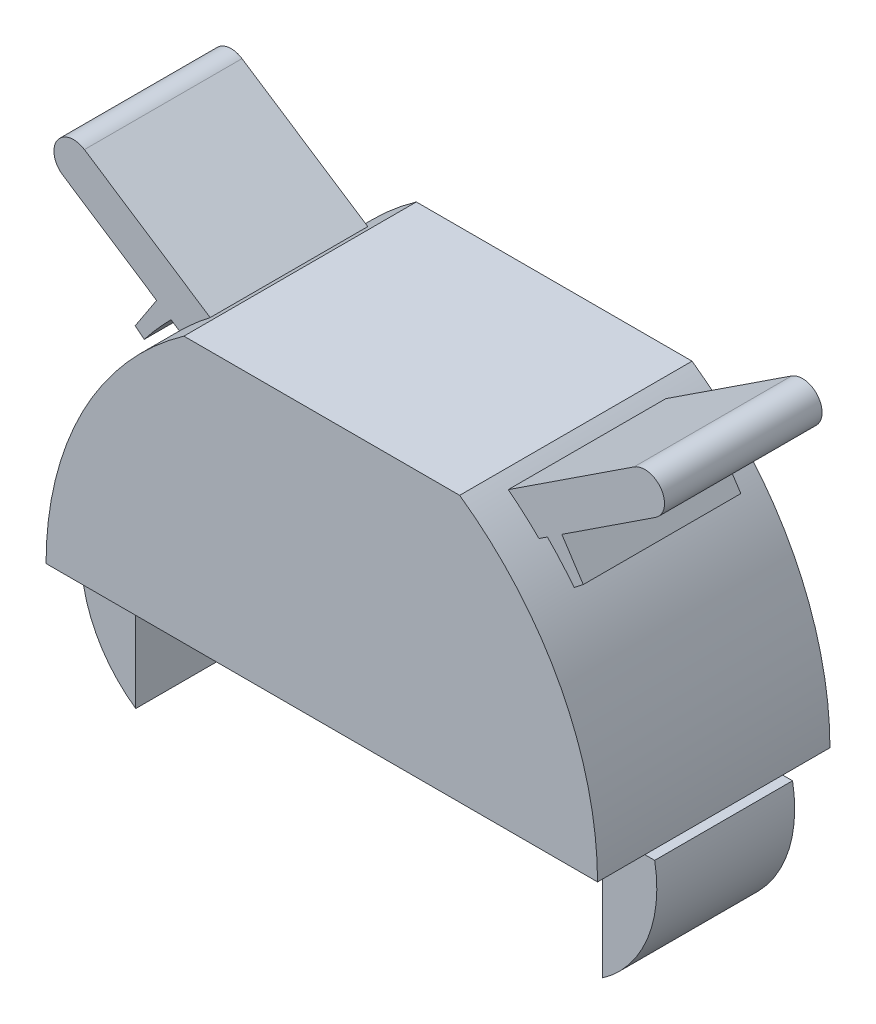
ISO-10303-21;
HEADER;
FILE_DESCRIPTION(('STEP AP214'),'2;1');
FILE_NAME('part.step','',(''),(''),'','','');
FILE_SCHEMA(('AUTOMOTIVE_DESIGN { 1 0 10303 214 1 1 1 1 }'));
ENDSEC;
DATA;
#1=APPLICATION_CONTEXT('core data for automotive mechanical design processes');
#2=APPLICATION_PROTOCOL_DEFINITION('international standard','automotive_design',2000,#1);
#3=PRODUCT_CONTEXT('',#1,'mechanical');
#4=PRODUCT('Part','Part','',(#3));
#5=PRODUCT_RELATED_PRODUCT_CATEGORY('part','',(#4));
#6=PRODUCT_DEFINITION_FORMATION('','',#4);
#7=PRODUCT_DEFINITION_CONTEXT('part definition',#1,'design');
#8=PRODUCT_DEFINITION('design','',#6,#7);
#9=PRODUCT_DEFINITION_SHAPE('','',#8);
#10=(LENGTH_UNIT() NAMED_UNIT(*) SI_UNIT(.MILLI.,.METRE.));
#11=(NAMED_UNIT(*) PLANE_ANGLE_UNIT() SI_UNIT($,.RADIAN.));
#12=(NAMED_UNIT(*) SI_UNIT($,.STERADIAN.) SOLID_ANGLE_UNIT());
#13=UNCERTAINTY_MEASURE_WITH_UNIT(LENGTH_MEASURE(1.E-05),#10,'distance_accuracy_value','');
#14=(GEOMETRIC_REPRESENTATION_CONTEXT(3) GLOBAL_UNCERTAINTY_ASSIGNED_CONTEXT((#13)) GLOBAL_UNIT_ASSIGNED_CONTEXT((#10,
#11,#12)) REPRESENTATION_CONTEXT('',''));
#15=CARTESIAN_POINT('',(0.,0.,0.));
#16=DIRECTION('',(0.,0.,1.));
#17=DIRECTION('',(1.,0.,0.));
#18=AXIS2_PLACEMENT_3D('',#15,#16,#17);
#19=CARTESIAN_POINT('',(2.51785714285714,0.,-5.9));
#20=DIRECTION('',(0.,0.,1.));
#21=DIRECTION('',(1.,0.,0.));
#22=AXIS2_PLACEMENT_3D('',#19,#20,#21);
#23=CYLINDRICAL_SURFACE('',#22,16.5178571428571);
#24=DIRECTION('',(0.,0.,1.));
#25=VECTOR('',#24,1.);
#26=CARTESIAN_POINT('',(-14.,0.,-5.9));
#27=LINE('',#26,#25);
#28=CARTESIAN_POINT('',(-14.,0.,-5.9));
#29=VERTEX_POINT('',#28);
#30=CARTESIAN_POINT('',(-14.,0.,-3.5));
#31=VERTEX_POINT('',#30);
#32=EDGE_CURVE('E483',#29,#31,#27,.T.);
#33=ORIENTED_EDGE('',*,*,#32,.T.);
#34=CARTESIAN_POINT('',(-14.,0.,3.5));
#35=VERTEX_POINT('',#34);
#36=EDGE_CURVE('E485',#31,#35,#27,.T.);
#37=ORIENTED_EDGE('',*,*,#36,.T.);
#38=CARTESIAN_POINT('',(-14.,0.,5.9));
#39=VERTEX_POINT('',#38);
#40=EDGE_CURVE('E486',#35,#39,#27,.T.);
#41=ORIENTED_EDGE('',*,*,#40,.T.);
#42=CARTESIAN_POINT('',(2.51785714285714,0.,5.9));
#43=DIRECTION('',(0.,0.,1.));
#44=DIRECTION('',(-1.,0.,0.));
#45=AXIS2_PLACEMENT_3D('',#42,#43,#44);
#46=CIRCLE('',#45,16.5178571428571);
#47=CARTESIAN_POINT('',(-7.,13.5,5.9));
#48=VERTEX_POINT('',#47);
#49=EDGE_CURVE('E460',#48,#39,#46,.T.);
#50=ORIENTED_EDGE('',*,*,#49,.F.);
#51=DIRECTION('',(0.,0.,1.));
#52=VECTOR('',#51,1.);
#53=CARTESIAN_POINT('',(-7.,13.5,-5.9));
#54=LINE('',#53,#52);
#55=CARTESIAN_POINT('',(-7.,13.5,-5.9));
#56=VERTEX_POINT('',#55);
#57=EDGE_CURVE('E487',#56,#48,#54,.T.);
#58=ORIENTED_EDGE('',*,*,#57,.F.);
#59=CARTESIAN_POINT('',(2.51785714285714,0.,-5.9));
#60=DIRECTION('',(0.,0.,1.));
#61=DIRECTION('',(-1.,0.,0.));
#62=AXIS2_PLACEMENT_3D('',#59,#60,#61);
#63=CIRCLE('',#62,16.5178571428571);
#64=EDGE_CURVE('E472',#56,#29,#63,.T.);
#65=ORIENTED_EDGE('',*,*,#64,.T.);
#66=EDGE_LOOP('',(#33,#37,#41,#50,#58,#65));
#67=FACE_BOUND('',#66,.T.);
#68=DIRECTION('',(0.,0.,1.));
#69=VECTOR('',#68,1.);
#70=CARTESIAN_POINT('',(-9.12659684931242,11.7152164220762,-4.));
#71=LINE('',#70,#69);
#72=CARTESIAN_POINT('',(-9.12659684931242,11.7152164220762,-4.));
#73=VERTEX_POINT('',#72);
#74=CARTESIAN_POINT('',(-9.12659684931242,11.7152164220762,4.));
#75=VERTEX_POINT('',#74);
#76=EDGE_CURVE('E56',#73,#75,#71,.T.);
#77=ORIENTED_EDGE('',*,*,#76,.F.);
#78=CARTESIAN_POINT('',(2.51785714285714,0.,-4.));
#79=DIRECTION('',(0.,0.,1.));
#80=DIRECTION('',(-1.,0.,0.));
#81=AXIS2_PLACEMENT_3D('',#78,#79,#80);
#82=CIRCLE('',#81,16.5178571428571);
#83=CARTESIAN_POINT('',(-7.56564026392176,13.0829157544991,-4.));
#84=VERTEX_POINT('',#83);
#85=EDGE_CURVE('E51',#84,#73,#82,.T.);
#86=ORIENTED_EDGE('',*,*,#85,.F.);
#87=DIRECTION('',(0.,0.,1.));
#88=VECTOR('',#87,1.);
#89=CARTESIAN_POINT('',(-7.56564026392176,13.0829157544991,-4.));
#90=LINE('',#89,#88);
#91=CARTESIAN_POINT('',(-7.56564026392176,13.0829157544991,4.));
#92=VERTEX_POINT('',#91);
#93=EDGE_CURVE('E307',#84,#92,#90,.T.);
#94=ORIENTED_EDGE('',*,*,#93,.T.);
#95=CARTESIAN_POINT('',(2.51785714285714,0.,4.));
#96=DIRECTION('',(0.,0.,1.));
#97=DIRECTION('',(-1.,0.,0.));
#98=AXIS2_PLACEMENT_3D('',#95,#96,#97);
#99=CIRCLE('',#98,16.5178571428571);
#100=EDGE_CURVE('E266',#92,#75,#99,.T.);
#101=ORIENTED_EDGE('',*,*,#100,.T.);
#102=EDGE_LOOP('',(#77,#86,#94,#101));
#103=FACE_BOUND('',#102,.T.);
#104=ADVANCED_FACE('F33',(#67,#103),#23,.T.);
#105=CARTESIAN_POINT('',(-2.51785714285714,0.,-5.9));
#106=DIRECTION('',(0.,0.,1.));
#107=DIRECTION('',(1.,0.,0.));
#108=AXIS2_PLACEMENT_3D('',#105,#106,#107);
#109=CYLINDRICAL_SURFACE('',#108,16.5178571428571);
#110=DIRECTION('',(0.,0.,1.));
#111=VECTOR('',#110,1.);
#112=CARTESIAN_POINT('',(7.,13.5,-5.9));
#113=LINE('',#112,#111);
#114=CARTESIAN_POINT('',(7.,13.5,-5.9));
#115=VERTEX_POINT('',#114);
#116=CARTESIAN_POINT('',(7.,13.5,5.9));
#117=VERTEX_POINT('',#116);
#118=EDGE_CURVE('E37',#115,#117,#113,.T.);
#119=ORIENTED_EDGE('',*,*,#118,.T.);
#120=CARTESIAN_POINT('',(-2.51785714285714,0.,5.9));
#121=DIRECTION('',(0.,0.,1.));
#122=DIRECTION('',(1.,0.,0.));
#123=AXIS2_PLACEMENT_3D('',#120,#121,#122);
#124=CIRCLE('',#123,16.5178571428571);
#125=CARTESIAN_POINT('',(14.,0.,5.9));
#126=VERTEX_POINT('',#125);
#127=EDGE_CURVE('E446',#126,#117,#124,.T.);
#128=ORIENTED_EDGE('',*,*,#127,.F.);
#129=DIRECTION('',(0.,0.,1.));
#130=VECTOR('',#129,1.);
#131=CARTESIAN_POINT('',(14.,0.,-5.9));
#132=LINE('',#131,#130);
#133=CARTESIAN_POINT('',(14.,0.,3.5));
#134=VERTEX_POINT('',#133);
#135=EDGE_CURVE('E482',#134,#126,#132,.T.);
#136=ORIENTED_EDGE('',*,*,#135,.F.);
#137=CARTESIAN_POINT('',(14.,0.,-3.5));
#138=VERTEX_POINT('',#137);
#139=EDGE_CURVE('E481',#138,#134,#132,.T.);
#140=ORIENTED_EDGE('',*,*,#139,.F.);
#141=CARTESIAN_POINT('',(14.,0.,-5.9));
#142=VERTEX_POINT('',#141);
#143=EDGE_CURVE('E478',#142,#138,#132,.T.);
#144=ORIENTED_EDGE('',*,*,#143,.F.);
#145=CARTESIAN_POINT('',(-2.51785714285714,0.,-5.9));
#146=DIRECTION('',(0.,0.,1.));
#147=DIRECTION('',(1.,0.,0.));
#148=AXIS2_PLACEMENT_3D('',#145,#146,#147);
#149=CIRCLE('',#148,16.5178571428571);
#150=EDGE_CURVE('E466',#142,#115,#149,.T.);
#151=ORIENTED_EDGE('',*,*,#150,.T.);
#152=EDGE_LOOP('',(#119,#128,#136,#140,#144,#151));
#153=FACE_BOUND('',#152,.T.);
#154=DIRECTION('',(0.,0.,1.));
#155=VECTOR('',#154,1.);
#156=CARTESIAN_POINT('',(7.56564026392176,13.0829157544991,-4.));
#157=LINE('',#156,#155);
#158=CARTESIAN_POINT('',(7.56564026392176,13.0829157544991,-4.));
#159=VERTEX_POINT('',#158);
#160=CARTESIAN_POINT('',(7.56564026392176,13.0829157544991,4.));
#161=VERTEX_POINT('',#160);
#162=EDGE_CURVE('E362',#159,#161,#157,.T.);
#163=ORIENTED_EDGE('',*,*,#162,.F.);
#164=CARTESIAN_POINT('',(-2.51785714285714,0.,-4.));
#165=DIRECTION('',(0.,0.,-1.));
#166=DIRECTION('',(1.,0.,0.));
#167=AXIS2_PLACEMENT_3D('',#164,#165,#166);
#168=CIRCLE('',#167,16.5178571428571);
#169=CARTESIAN_POINT('',(9.12659684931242,11.7152164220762,-4.));
#170=VERTEX_POINT('',#169);
#171=EDGE_CURVE('E351',#159,#170,#168,.T.);
#172=ORIENTED_EDGE('',*,*,#171,.T.);
#173=DIRECTION('',(0.,0.,1.));
#174=VECTOR('',#173,1.);
#175=CARTESIAN_POINT('',(9.12659684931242,11.7152164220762,-4.));
#176=LINE('',#175,#174);
#177=CARTESIAN_POINT('',(9.12659684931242,11.7152164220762,4.));
#178=VERTEX_POINT('',#177);
#179=EDGE_CURVE('E360',#170,#178,#176,.T.);
#180=ORIENTED_EDGE('',*,*,#179,.T.);
#181=CARTESIAN_POINT('',(-2.51785714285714,0.,4.));
#182=DIRECTION('',(0.,0.,-1.));
#183=DIRECTION('',(1.,0.,0.));
#184=AXIS2_PLACEMENT_3D('',#181,#182,#183);
#185=CIRCLE('',#184,16.5178571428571);
#186=EDGE_CURVE('E327',#161,#178,#185,.T.);
#187=ORIENTED_EDGE('',*,*,#186,.F.);
#188=EDGE_LOOP('',(#163,#172,#180,#187));
#189=FACE_BOUND('',#188,.T.);
#190=ADVANCED_FACE('F35',(#153,#189),#109,.T.);
#191=CARTESIAN_POINT('',(-14.,0.,-5.9));
#192=DIRECTION('',(0.,-1.,0.));
#193=DIRECTION('',(0.,0.,-1.));
#194=AXIS2_PLACEMENT_3D('',#191,#192,#193);
#195=PLANE('',#194);
#196=DIRECTION('',(-1.,0.,0.));
#197=VECTOR('',#196,1.);
#198=CARTESIAN_POINT('',(-14.,0.,-3.5));
#199=LINE('',#198,#197);
#200=CARTESIAN_POINT('',(-12.,0.,-3.5));
#201=VERTEX_POINT('',#200);
#202=EDGE_CURVE('E401',#201,#31,#199,.T.);
#203=ORIENTED_EDGE('',*,*,#202,.T.);
#204=ORIENTED_EDGE('',*,*,#32,.F.);
#205=DIRECTION('',(1.,0.,0.));
#206=VECTOR('',#205,1.);
#207=CARTESIAN_POINT('',(-14.,0.,-5.9));
#208=LINE('',#207,#206);
#209=EDGE_CURVE('E475',#29,#142,#208,.T.);
#210=ORIENTED_EDGE('',*,*,#209,.T.);
#211=ORIENTED_EDGE('',*,*,#143,.T.);
#212=DIRECTION('',(-1.,0.,0.));
#213=VECTOR('',#212,1.);
#214=CARTESIAN_POINT('',(14.,0.,-3.5));
#215=LINE('',#214,#213);
#216=CARTESIAN_POINT('',(12.,0.,-3.5));
#217=VERTEX_POINT('',#216);
#218=EDGE_CURVE('E42',#138,#217,#215,.T.);
#219=ORIENTED_EDGE('',*,*,#218,.T.);
#220=DIRECTION('',(0.,0.,1.));
#221=VECTOR('',#220,1.);
#222=CARTESIAN_POINT('',(12.,0.,-3.5));
#223=LINE('',#222,#221);
#224=CARTESIAN_POINT('',(12.,0.,3.5));
#225=VERTEX_POINT('',#224);
#226=EDGE_CURVE('E443',#217,#225,#223,.T.);
#227=ORIENTED_EDGE('',*,*,#226,.T.);
#228=DIRECTION('',(-1.,0.,0.));
#229=VECTOR('',#228,1.);
#230=CARTESIAN_POINT('',(14.,0.,3.5));
#231=LINE('',#230,#229);
#232=EDGE_CURVE('E11',#134,#225,#231,.T.);
#233=ORIENTED_EDGE('',*,*,#232,.F.);
#234=ORIENTED_EDGE('',*,*,#135,.T.);
#235=DIRECTION('',(1.,0.,0.));
#236=VECTOR('',#235,1.);
#237=CARTESIAN_POINT('',(-14.,0.,5.9));
#238=LINE('',#237,#236);
#239=EDGE_CURVE('E463',#39,#126,#238,.T.);
#240=ORIENTED_EDGE('',*,*,#239,.F.);
#241=ORIENTED_EDGE('',*,*,#40,.F.);
#242=DIRECTION('',(-1.,0.,0.));
#243=VECTOR('',#242,1.);
#244=CARTESIAN_POINT('',(-14.,0.,3.5));
#245=LINE('',#244,#243);
#246=CARTESIAN_POINT('',(-12.,0.,3.5));
#247=VERTEX_POINT('',#246);
#248=EDGE_CURVE('E386',#247,#35,#245,.T.);
#249=ORIENTED_EDGE('',*,*,#248,.F.);
#250=DIRECTION('',(0.,0.,1.));
#251=VECTOR('',#250,1.);
#252=CARTESIAN_POINT('',(-12.,0.,-3.5));
#253=LINE('',#252,#251);
#254=EDGE_CURVE('E408',#201,#247,#253,.T.);
#255=ORIENTED_EDGE('',*,*,#254,.F.);
#256=EDGE_LOOP('',(#203,#204,#210,#211,#219,#227,#233,#234,#240,#241,#249,#255));
#257=FACE_BOUND('',#256,.T.);
#258=ADVANCED_FACE('F503',(#257),#195,.T.);
#259=CARTESIAN_POINT('',(-7.,13.5,-5.9));
#260=DIRECTION('',(0.,1.,0.));
#261=DIRECTION('',(0.,0.,1.));
#262=AXIS2_PLACEMENT_3D('',#259,#260,#261);
#263=PLANE('',#262);
#264=ORIENTED_EDGE('',*,*,#57,.T.);
#265=DIRECTION('',(-1.,0.,0.));
#266=VECTOR('',#265,1.);
#267=CARTESIAN_POINT('',(-7.,13.5,5.9));
#268=LINE('',#267,#266);
#269=EDGE_CURVE('E457',#117,#48,#268,.T.);
#270=ORIENTED_EDGE('',*,*,#269,.F.);
#271=ORIENTED_EDGE('',*,*,#118,.F.);
#272=DIRECTION('',(-1.,0.,0.));
#273=VECTOR('',#272,1.);
#274=CARTESIAN_POINT('',(-7.,13.5,-5.9));
#275=LINE('',#274,#273);
#276=EDGE_CURVE('E469',#115,#56,#275,.T.);
#277=ORIENTED_EDGE('',*,*,#276,.T.);
#278=EDGE_LOOP('',(#264,#270,#271,#277));
#279=FACE_BOUND('',#278,.T.);
#280=ADVANCED_FACE('F496',(#279),#263,.T.);
#281=CARTESIAN_POINT('',(-2.51785714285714,0.,-5.9));
#282=DIRECTION('',(0.,0.,1.));
#283=DIRECTION('',(1.,0.,0.));
#284=AXIS2_PLACEMENT_3D('',#281,#282,#283);
#285=PLANE('',#284);
#286=ORIENTED_EDGE('',*,*,#150,.F.);
#287=ORIENTED_EDGE('',*,*,#209,.F.);
#288=ORIENTED_EDGE('',*,*,#64,.F.);
#289=ORIENTED_EDGE('',*,*,#276,.F.);
#290=EDGE_LOOP('',(#286,#287,#288,#289));
#291=FACE_BOUND('',#290,.T.);
#292=ADVANCED_FACE('F535',(#291),#285,.F.);
#293=CARTESIAN_POINT('',(-2.51785714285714,0.,5.9));
#294=DIRECTION('',(0.,0.,1.));
#295=DIRECTION('',(1.,0.,0.));
#296=AXIS2_PLACEMENT_3D('',#293,#294,#295);
#297=PLANE('',#296);
#298=ORIENTED_EDGE('',*,*,#127,.T.);
#299=ORIENTED_EDGE('',*,*,#269,.T.);
#300=ORIENTED_EDGE('',*,*,#49,.T.);
#301=ORIENTED_EDGE('',*,*,#239,.T.);
#302=EDGE_LOOP('',(#298,#299,#300,#301));
#303=FACE_BOUND('',#302,.T.);
#304=ADVANCED_FACE('F499',(#303),#297,.T.);
#305=CARTESIAN_POINT('',(14.,0.,-3.5));
#306=DIRECTION('',(0.,1.,0.));
#307=DIRECTION('',(0.,0.,1.));
#308=AXIS2_PLACEMENT_3D('',#305,#306,#307);
#309=PLANE('',#308);
#310=CARTESIAN_POINT('',(14.5,0.,-3.5));
#311=VERTEX_POINT('',#310);
#312=EDGE_CURVE('E428',#311,#138,#215,.T.);
#313=ORIENTED_EDGE('',*,*,#312,.T.);
#314=ORIENTED_EDGE('',*,*,#139,.T.);
#315=CARTESIAN_POINT('',(14.5,0.,3.5));
#316=VERTEX_POINT('',#315);
#317=EDGE_CURVE('E44',#316,#134,#231,.T.);
#318=ORIENTED_EDGE('',*,*,#317,.F.);
#319=DIRECTION('',(0.,0.,1.));
#320=VECTOR('',#319,1.);
#321=CARTESIAN_POINT('',(14.5,0.,-3.5));
#322=LINE('',#321,#320);
#323=EDGE_CURVE('E444',#311,#316,#322,.T.);
#324=ORIENTED_EDGE('',*,*,#323,.F.);
#325=EDGE_LOOP('',(#313,#314,#318,#324));
#326=FACE_BOUND('',#325,.T.);
#327=ADVANCED_FACE('F510',(#326),#309,.T.);
#328=CARTESIAN_POINT('',(8.12101233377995,-1.18724835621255,-3.5));
#329=DIRECTION('',(0.,0.,1.));
#330=DIRECTION('',(1.,0.,0.));
#331=AXIS2_PLACEMENT_3D('',#328,#329,#330);
#332=CYLINDRICAL_SURFACE('',#331,6.48853159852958);
#333=ORIENTED_EDGE('',*,*,#323,.T.);
#334=CARTESIAN_POINT('',(8.12101233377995,-1.18724835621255,3.5));
#335=DIRECTION('',(0.,0.,1.));
#336=DIRECTION('',(1.,0.,0.));
#337=AXIS2_PLACEMENT_3D('',#334,#335,#336);
#338=CIRCLE('',#337,6.48853159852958);
#339=CARTESIAN_POINT('',(11.8460240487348,-6.5,3.5));
#340=VERTEX_POINT('',#339);
#341=EDGE_CURVE('E425',#340,#316,#338,.T.);
#342=ORIENTED_EDGE('',*,*,#341,.F.);
#343=DIRECTION('',(0.,0.,1.));
#344=VECTOR('',#343,1.);
#345=CARTESIAN_POINT('',(11.8460240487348,-6.5,-3.5));
#346=LINE('',#345,#344);
#347=CARTESIAN_POINT('',(11.8460240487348,-6.5,-3.5));
#348=VERTEX_POINT('',#347);
#349=EDGE_CURVE('E447',#348,#340,#346,.T.);
#350=ORIENTED_EDGE('',*,*,#349,.F.);
#351=CARTESIAN_POINT('',(8.12101233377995,-1.18724835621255,-3.5));
#352=DIRECTION('',(0.,0.,1.));
#353=DIRECTION('',(1.,0.,0.));
#354=AXIS2_PLACEMENT_3D('',#351,#352,#353);
#355=CIRCLE('',#354,6.48853159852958);
#356=EDGE_CURVE('E440',#348,#311,#355,.T.);
#357=ORIENTED_EDGE('',*,*,#356,.T.);
#358=EDGE_LOOP('',(#333,#342,#350,#357));
#359=FACE_BOUND('',#358,.T.);
#360=ADVANCED_FACE('F518',(#359),#332,.T.);
#361=CARTESIAN_POINT('',(11.8460240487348,-1.3,-3.5));
#362=DIRECTION('',(-1.,0.,0.));
#363=DIRECTION('',(0.,0.,1.));
#364=AXIS2_PLACEMENT_3D('',#361,#362,#363);
#365=PLANE('',#364);
#366=ORIENTED_EDGE('',*,*,#349,.T.);
#367=DIRECTION('',(0.,-1.,0.));
#368=VECTOR('',#367,1.);
#369=CARTESIAN_POINT('',(11.8460240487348,-1.3,3.5));
#370=LINE('',#369,#368);
#371=CARTESIAN_POINT('',(11.8460240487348,-1.3,3.5));
#372=VERTEX_POINT('',#371);
#373=EDGE_CURVE('E422',#372,#340,#370,.T.);
#374=ORIENTED_EDGE('',*,*,#373,.F.);
#375=DIRECTION('',(0.,0.,1.));
#376=VECTOR('',#375,1.);
#377=CARTESIAN_POINT('',(11.8460240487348,-1.3,-3.5));
#378=LINE('',#377,#376);
#379=CARTESIAN_POINT('',(11.8460240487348,-1.3,-3.5));
#380=VERTEX_POINT('',#379);
#381=EDGE_CURVE('E449',#380,#372,#378,.T.);
#382=ORIENTED_EDGE('',*,*,#381,.F.);
#383=DIRECTION('',(0.,-1.,0.));
#384=VECTOR('',#383,1.);
#385=CARTESIAN_POINT('',(11.8460240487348,-1.3,-3.5));
#386=LINE('',#385,#384);
#387=EDGE_CURVE('E437',#380,#348,#386,.T.);
#388=ORIENTED_EDGE('',*,*,#387,.T.);
#389=EDGE_LOOP('',(#366,#374,#382,#388));
#390=FACE_BOUND('',#389,.T.);
#391=ADVANCED_FACE('F525',(#390),#365,.T.);
#392=CARTESIAN_POINT('',(12.,-1.3,-3.5));
#393=DIRECTION('',(0.,1.,0.));
#394=DIRECTION('',(-1.,0.,0.));
#395=AXIS2_PLACEMENT_3D('',#392,#393,#394);
#396=PLANE('',#395);
#397=ORIENTED_EDGE('',*,*,#381,.T.);
#398=DIRECTION('',(-1.,0.,0.));
#399=VECTOR('',#398,1.);
#400=CARTESIAN_POINT('',(12.,-1.3,3.5));
#401=LINE('',#400,#399);
#402=CARTESIAN_POINT('',(12.,-1.3,3.5));
#403=VERTEX_POINT('',#402);
#404=EDGE_CURVE('E419',#403,#372,#401,.T.);
#405=ORIENTED_EDGE('',*,*,#404,.F.);
#406=DIRECTION('',(0.,0.,1.));
#407=VECTOR('',#406,1.);
#408=CARTESIAN_POINT('',(12.,-1.3,-3.5));
#409=LINE('',#408,#407);
#410=CARTESIAN_POINT('',(12.,-1.3,-3.5));
#411=VERTEX_POINT('',#410);
#412=EDGE_CURVE('E451',#411,#403,#409,.T.);
#413=ORIENTED_EDGE('',*,*,#412,.F.);
#414=DIRECTION('',(-1.,0.,0.));
#415=VECTOR('',#414,1.);
#416=CARTESIAN_POINT('',(12.,-1.3,-3.5));
#417=LINE('',#416,#415);
#418=EDGE_CURVE('E434',#411,#380,#417,.T.);
#419=ORIENTED_EDGE('',*,*,#418,.T.);
#420=EDGE_LOOP('',(#397,#405,#413,#419));
#421=FACE_BOUND('',#420,.T.);
#422=ADVANCED_FACE('F528',(#421),#396,.T.);
#423=CARTESIAN_POINT('',(12.,0.,-3.5));
#424=DIRECTION('',(-1.,0.,0.));
#425=DIRECTION('',(0.,0.,1.));
#426=AXIS2_PLACEMENT_3D('',#423,#424,#425);
#427=PLANE('',#426);
#428=ORIENTED_EDGE('',*,*,#412,.T.);
#429=DIRECTION('',(0.,-1.,0.));
#430=VECTOR('',#429,1.);
#431=CARTESIAN_POINT('',(12.,0.,3.5));
#432=LINE('',#431,#430);
#433=EDGE_CURVE('E416',#225,#403,#432,.T.);
#434=ORIENTED_EDGE('',*,*,#433,.F.);
#435=ORIENTED_EDGE('',*,*,#226,.F.);
#436=DIRECTION('',(0.,-1.,0.));
#437=VECTOR('',#436,1.);
#438=CARTESIAN_POINT('',(12.,0.,-3.5));
#439=LINE('',#438,#437);
#440=EDGE_CURVE('E431',#217,#411,#439,.T.);
#441=ORIENTED_EDGE('',*,*,#440,.T.);
#442=EDGE_LOOP('',(#428,#434,#435,#441));
#443=FACE_BOUND('',#442,.T.);
#444=ADVANCED_FACE('F531',(#443),#427,.T.);
#445=CARTESIAN_POINT('',(8.12101233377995,-1.18724835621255,-3.5));
#446=DIRECTION('',(0.,0.,1.));
#447=DIRECTION('',(1.,0.,0.));
#448=AXIS2_PLACEMENT_3D('',#445,#446,#447);
#449=PLANE('',#448);
#450=ORIENTED_EDGE('',*,*,#312,.F.);
#451=ORIENTED_EDGE('',*,*,#356,.F.);
#452=ORIENTED_EDGE('',*,*,#387,.F.);
#453=ORIENTED_EDGE('',*,*,#418,.F.);
#454=ORIENTED_EDGE('',*,*,#440,.F.);
#455=ORIENTED_EDGE('',*,*,#218,.F.);
#456=EDGE_LOOP('',(#450,#451,#452,#453,#454,#455));
#457=FACE_BOUND('',#456,.T.);
#458=ADVANCED_FACE('F522',(#457),#449,.F.);
#459=CARTESIAN_POINT('',(8.12101233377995,-1.18724835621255,3.5));
#460=DIRECTION('',(0.,0.,1.));
#461=DIRECTION('',(1.,0.,0.));
#462=AXIS2_PLACEMENT_3D('',#459,#460,#461);
#463=PLANE('',#462);
#464=ORIENTED_EDGE('',*,*,#317,.T.);
#465=ORIENTED_EDGE('',*,*,#232,.T.);
#466=ORIENTED_EDGE('',*,*,#433,.T.);
#467=ORIENTED_EDGE('',*,*,#404,.T.);
#468=ORIENTED_EDGE('',*,*,#373,.T.);
#469=ORIENTED_EDGE('',*,*,#341,.T.);
#470=EDGE_LOOP('',(#464,#465,#466,#467,#468,#469));
#471=FACE_BOUND('',#470,.T.);
#472=ADVANCED_FACE('F513',(#471),#463,.T.);
#473=CARTESIAN_POINT('',(-8.12101233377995,-1.18724835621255,-3.5));
#474=DIRECTION('',(0.,0.,1.));
#475=DIRECTION('',(1.,0.,0.));
#476=AXIS2_PLACEMENT_3D('',#473,#474,#475);
#477=CYLINDRICAL_SURFACE('',#476,6.48853159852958);
#478=DIRECTION('',(0.,0.,1.));
#479=VECTOR('',#478,1.);
#480=CARTESIAN_POINT('',(-11.8460240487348,-6.5,-3.5));
#481=LINE('',#480,#479);
#482=CARTESIAN_POINT('',(-11.8460240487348,-6.5,-3.5));
#483=VERTEX_POINT('',#482);
#484=CARTESIAN_POINT('',(-11.8460240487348,-6.5,3.5));
#485=VERTEX_POINT('',#484);
#486=EDGE_CURVE('E404',#483,#485,#481,.T.);
#487=ORIENTED_EDGE('',*,*,#486,.T.);
#488=CARTESIAN_POINT('',(-8.12101233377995,-1.18724835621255,3.5));
#489=DIRECTION('',(0.,0.,1.));
#490=DIRECTION('',(-1.,0.,0.));
#491=AXIS2_PLACEMENT_3D('',#488,#489,#490);
#492=CIRCLE('',#491,6.48853159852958);
#493=CARTESIAN_POINT('',(-14.5,0.,3.5));
#494=VERTEX_POINT('',#493);
#495=EDGE_CURVE('E359',#494,#485,#492,.T.);
#496=ORIENTED_EDGE('',*,*,#495,.F.);
#497=DIRECTION('',(0.,0.,1.));
#498=VECTOR('',#497,1.);
#499=CARTESIAN_POINT('',(-14.5,0.,-3.5));
#500=LINE('',#499,#498);
#501=CARTESIAN_POINT('',(-14.5,0.,-3.5));
#502=VERTEX_POINT('',#501);
#503=EDGE_CURVE('E405',#502,#494,#500,.T.);
#504=ORIENTED_EDGE('',*,*,#503,.F.);
#505=CARTESIAN_POINT('',(-8.12101233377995,-1.18724835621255,-3.5));
#506=DIRECTION('',(0.,0.,1.));
#507=DIRECTION('',(-1.,0.,0.));
#508=AXIS2_PLACEMENT_3D('',#505,#506,#507);
#509=CIRCLE('',#508,6.48853159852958);
#510=EDGE_CURVE('E388',#502,#483,#509,.T.);
#511=ORIENTED_EDGE('',*,*,#510,.T.);
#512=EDGE_LOOP('',(#487,#496,#504,#511));
#513=FACE_BOUND('',#512,.T.);
#514=ADVANCED_FACE('F563',(#513),#477,.T.);
#515=CARTESIAN_POINT('',(-14.,0.,-3.5));
#516=DIRECTION('',(0.,1.,0.));
#517=DIRECTION('',(0.,0.,1.));
#518=AXIS2_PLACEMENT_3D('',#515,#516,#517);
#519=PLANE('',#518);
#520=EDGE_CURVE('E385',#35,#494,#245,.T.);
#521=ORIENTED_EDGE('',*,*,#520,.F.);
#522=ORIENTED_EDGE('',*,*,#36,.F.);
#523=EDGE_CURVE('E400',#31,#502,#199,.T.);
#524=ORIENTED_EDGE('',*,*,#523,.T.);
#525=ORIENTED_EDGE('',*,*,#503,.T.);
#526=EDGE_LOOP('',(#521,#522,#524,#525));
#527=FACE_BOUND('',#526,.T.);
#528=ADVANCED_FACE('F541',(#527),#519,.T.);
#529=CARTESIAN_POINT('',(-12.,0.,-3.5));
#530=DIRECTION('',(1.,0.,0.));
#531=DIRECTION('',(0.,0.,-1.));
#532=AXIS2_PLACEMENT_3D('',#529,#530,#531);
#533=PLANE('',#532);
#534=ORIENTED_EDGE('',*,*,#254,.T.);
#535=DIRECTION('',(0.,1.,0.));
#536=VECTOR('',#535,1.);
#537=CARTESIAN_POINT('',(-12.,0.,3.5));
#538=LINE('',#537,#536);
#539=CARTESIAN_POINT('',(-12.,-1.3,3.5));
#540=VERTEX_POINT('',#539);
#541=EDGE_CURVE('E382',#540,#247,#538,.T.);
#542=ORIENTED_EDGE('',*,*,#541,.F.);
#543=DIRECTION('',(0.,0.,1.));
#544=VECTOR('',#543,1.);
#545=CARTESIAN_POINT('',(-12.,-1.3,-3.5));
#546=LINE('',#545,#544);
#547=CARTESIAN_POINT('',(-12.,-1.3,-3.5));
#548=VERTEX_POINT('',#547);
#549=EDGE_CURVE('E410',#548,#540,#546,.T.);
#550=ORIENTED_EDGE('',*,*,#549,.F.);
#551=DIRECTION('',(0.,1.,0.));
#552=VECTOR('',#551,1.);
#553=CARTESIAN_POINT('',(-12.,0.,-3.5));
#554=LINE('',#553,#552);
#555=EDGE_CURVE('E397',#548,#201,#554,.T.);
#556=ORIENTED_EDGE('',*,*,#555,.T.);
#557=EDGE_LOOP('',(#534,#542,#550,#556));
#558=FACE_BOUND('',#557,.T.);
#559=ADVANCED_FACE('F551',(#558),#533,.T.);
#560=CARTESIAN_POINT('',(-12.,-1.3,-3.5));
#561=DIRECTION('',(0.,1.,0.));
#562=DIRECTION('',(-1.,0.,0.));
#563=AXIS2_PLACEMENT_3D('',#560,#561,#562);
#564=PLANE('',#563);
#565=ORIENTED_EDGE('',*,*,#549,.T.);
#566=DIRECTION('',(-1.,0.,0.));
#567=VECTOR('',#566,1.);
#568=CARTESIAN_POINT('',(-12.,-1.3,3.5));
#569=LINE('',#568,#567);
#570=CARTESIAN_POINT('',(-11.8460240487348,-1.3,3.5));
#571=VERTEX_POINT('',#570);
#572=EDGE_CURVE('E379',#571,#540,#569,.T.);
#573=ORIENTED_EDGE('',*,*,#572,.F.);
#574=DIRECTION('',(0.,0.,1.));
#575=VECTOR('',#574,1.);
#576=CARTESIAN_POINT('',(-11.8460240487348,-1.3,-3.5));
#577=LINE('',#576,#575);
#578=CARTESIAN_POINT('',(-11.8460240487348,-1.3,-3.5));
#579=VERTEX_POINT('',#578);
#580=EDGE_CURVE('E412',#579,#571,#577,.T.);
#581=ORIENTED_EDGE('',*,*,#580,.F.);
#582=DIRECTION('',(-1.,0.,0.));
#583=VECTOR('',#582,1.);
#584=CARTESIAN_POINT('',(-12.,-1.3,-3.5));
#585=LINE('',#584,#583);
#586=EDGE_CURVE('E394',#579,#548,#585,.T.);
#587=ORIENTED_EDGE('',*,*,#586,.T.);
#588=EDGE_LOOP('',(#565,#573,#581,#587));
#589=FACE_BOUND('',#588,.T.);
#590=ADVANCED_FACE('F557',(#589),#564,.T.);
#591=CARTESIAN_POINT('',(-11.8460240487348,-1.3,-3.5));
#592=DIRECTION('',(1.,0.,0.));
#593=DIRECTION('',(0.,0.,-1.));
#594=AXIS2_PLACEMENT_3D('',#591,#592,#593);
#595=PLANE('',#594);
#596=ORIENTED_EDGE('',*,*,#580,.T.);
#597=DIRECTION('',(0.,1.,0.));
#598=VECTOR('',#597,1.);
#599=CARTESIAN_POINT('',(-11.8460240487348,-1.3,3.5));
#600=LINE('',#599,#598);
#601=EDGE_CURVE('E376',#485,#571,#600,.T.);
#602=ORIENTED_EDGE('',*,*,#601,.F.);
#603=ORIENTED_EDGE('',*,*,#486,.F.);
#604=DIRECTION('',(0.,1.,0.));
#605=VECTOR('',#604,1.);
#606=CARTESIAN_POINT('',(-11.8460240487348,-1.3,-3.5));
#607=LINE('',#606,#605);
#608=EDGE_CURVE('E391',#483,#579,#607,.T.);
#609=ORIENTED_EDGE('',*,*,#608,.T.);
#610=EDGE_LOOP('',(#596,#602,#603,#609));
#611=FACE_BOUND('',#610,.T.);
#612=ADVANCED_FACE('F560',(#611),#595,.T.);
#613=CARTESIAN_POINT('',(-8.12101233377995,-1.18724835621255,-3.5));
#614=DIRECTION('',(0.,0.,-1.));
#615=DIRECTION('',(-1.,0.,0.));
#616=AXIS2_PLACEMENT_3D('',#613,#614,#615);
#617=PLANE('',#616);
#618=ORIENTED_EDGE('',*,*,#510,.F.);
#619=ORIENTED_EDGE('',*,*,#523,.F.);
#620=ORIENTED_EDGE('',*,*,#202,.F.);
#621=ORIENTED_EDGE('',*,*,#555,.F.);
#622=ORIENTED_EDGE('',*,*,#586,.F.);
#623=ORIENTED_EDGE('',*,*,#608,.F.);
#624=EDGE_LOOP('',(#618,#619,#620,#621,#622,#623));
#625=FACE_BOUND('',#624,.T.);
#626=ADVANCED_FACE('F545',(#625),#617,.T.);
#627=CARTESIAN_POINT('',(-8.12101233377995,-1.18724835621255,3.5));
#628=DIRECTION('',(0.,0.,-1.));
#629=DIRECTION('',(-1.,0.,0.));
#630=AXIS2_PLACEMENT_3D('',#627,#628,#629);
#631=PLANE('',#630);
#632=ORIENTED_EDGE('',*,*,#495,.T.);
#633=ORIENTED_EDGE('',*,*,#601,.T.);
#634=ORIENTED_EDGE('',*,*,#572,.T.);
#635=ORIENTED_EDGE('',*,*,#541,.T.);
#636=ORIENTED_EDGE('',*,*,#248,.T.);
#637=ORIENTED_EDGE('',*,*,#520,.T.);
#638=EDGE_LOOP('',(#632,#633,#634,#635,#636,#637));
#639=FACE_BOUND('',#638,.T.);
#640=ADVANCED_FACE('F553',(#639),#631,.F.);
#641=CARTESIAN_POINT('',(-2.51785714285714,0.,-4.));
#642=DIRECTION('',(0.,0.,1.));
#643=DIRECTION('',(1.,0.,0.));
#644=AXIS2_PLACEMENT_3D('',#641,#642,#643);
#645=CYLINDRICAL_SURFACE('',#644,17.0178571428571);
#646=DIRECTION('',(0.,0.,1.));
#647=VECTOR('',#646,1.);
#648=CARTESIAN_POINT('',(10.9114390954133,10.4528208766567,-4.));
#649=LINE('',#648,#647);
#650=CARTESIAN_POINT('',(10.9114390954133,10.4528208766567,-4.));
#651=VERTEX_POINT('',#650);
#652=CARTESIAN_POINT('',(10.9114390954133,10.4528208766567,4.));
#653=VERTEX_POINT('',#652);
#654=EDGE_CURVE('E356',#651,#653,#649,.T.);
#655=ORIENTED_EDGE('',*,*,#654,.T.);
#656=CARTESIAN_POINT('',(-2.51785714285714,0.,4.));
#657=DIRECTION('',(0.,0.,-1.));
#658=DIRECTION('',(1.,0.,0.));
#659=AXIS2_PLACEMENT_3D('',#656,#657,#658);
#660=CIRCLE('',#659,17.0178571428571);
#661=CARTESIAN_POINT('',(9.55344933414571,11.9954583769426,4.));
#662=VERTEX_POINT('',#661);
#663=EDGE_CURVE('E298',#662,#653,#660,.T.);
#664=ORIENTED_EDGE('',*,*,#663,.F.);
#665=DIRECTION('',(0.,0.,1.));
#666=VECTOR('',#665,1.);
#667=CARTESIAN_POINT('',(9.55344933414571,11.9954583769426,-4.));
#668=LINE('',#667,#666);
#669=CARTESIAN_POINT('',(9.55344933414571,11.9954583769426,-4.));
#670=VERTEX_POINT('',#669);
#671=EDGE_CURVE('E357',#670,#662,#668,.T.);
#672=ORIENTED_EDGE('',*,*,#671,.F.);
#673=CARTESIAN_POINT('',(-2.51785714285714,0.,-4.));
#674=DIRECTION('',(0.,0.,-1.));
#675=DIRECTION('',(1.,0.,0.));
#676=AXIS2_PLACEMENT_3D('',#673,#674,#675);
#677=CIRCLE('',#676,17.0178571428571);
#678=EDGE_CURVE('E333',#670,#651,#677,.T.);
#679=ORIENTED_EDGE('',*,*,#678,.T.);
#680=EDGE_LOOP('',(#655,#664,#672,#679));
#681=FACE_BOUND('',#680,.T.);
#682=ADVANCED_FACE('F604',(#681),#645,.F.);
#683=CARTESIAN_POINT('',(9.55344933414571,11.9954583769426,-4.));
#684=DIRECTION('',(0.548820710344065,-0.835940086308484,0.));
#685=DIRECTION('',(0.835940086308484,0.548820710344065,0.));
#686=AXIS2_PLACEMENT_3D('',#683,#684,#685);
#687=PLANE('',#686);
#688=ORIENTED_EDGE('',*,*,#671,.T.);
#689=DIRECTION('',(0.835940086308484,0.548820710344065,0.));
#690=VECTOR('',#689,1.);
#691=CARTESIAN_POINT('',(9.55344933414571,11.9954583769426,4.));
#692=LINE('',#691,#690);
#693=EDGE_CURVE('E330',#178,#662,#692,.T.);
#694=ORIENTED_EDGE('',*,*,#693,.F.);
#695=ORIENTED_EDGE('',*,*,#179,.F.);
#696=DIRECTION('',(0.835940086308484,0.548820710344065,0.));
#697=VECTOR('',#696,1.);
#698=CARTESIAN_POINT('',(9.55344933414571,11.9954583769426,-4.));
#699=LINE('',#698,#697);
#700=EDGE_CURVE('E353',#170,#670,#699,.T.);
#701=ORIENTED_EDGE('',*,*,#700,.T.);
#702=EDGE_LOOP('',(#688,#694,#695,#701));
#703=FACE_BOUND('',#702,.T.);
#704=ADVANCED_FACE('F608',(#703),#687,.T.);
#705=CARTESIAN_POINT('',(13.9511792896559,17.2752210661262,-4.));
#706=DIRECTION('',(-0.548820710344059,0.835940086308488,0.));
#707=DIRECTION('',(-0.835940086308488,-0.548820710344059,0.));
#708=AXIS2_PLACEMENT_3D('',#705,#706,#707);
#709=PLANE('',#708);
#710=ORIENTED_EDGE('',*,*,#162,.T.);
#711=DIRECTION('',(-0.835940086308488,-0.548820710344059,0.));
#712=VECTOR('',#711,1.);
#713=CARTESIAN_POINT('',(13.9511792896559,17.2752210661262,4.));
#714=LINE('',#713,#712);
#715=CARTESIAN_POINT('',(13.9511792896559,17.2752210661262,4.));
#716=VERTEX_POINT('',#715);
#717=EDGE_CURVE('E324',#716,#161,#714,.T.);
#718=ORIENTED_EDGE('',*,*,#717,.F.);
#719=DIRECTION('',(0.,0.,1.));
#720=VECTOR('',#719,1.);
#721=CARTESIAN_POINT('',(13.9511792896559,17.2752210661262,-4.));
#722=LINE('',#721,#720);
#723=CARTESIAN_POINT('',(13.9511792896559,17.2752210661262,-4.));
#724=VERTEX_POINT('',#723);
#725=EDGE_CURVE('E365',#724,#716,#722,.T.);
#726=ORIENTED_EDGE('',*,*,#725,.F.);
#727=DIRECTION('',(-0.835940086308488,-0.548820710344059,0.));
#728=VECTOR('',#727,1.);
#729=CARTESIAN_POINT('',(13.9511792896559,17.2752210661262,-4.));
#730=LINE('',#729,#728);
#731=EDGE_CURVE('E348',#724,#159,#730,.T.);
#732=ORIENTED_EDGE('',*,*,#731,.T.);
#733=EDGE_LOOP('',(#710,#718,#726,#732));
#734=FACE_BOUND('',#733,.T.);
#735=ADVANCED_FACE('F618',(#734),#709,.T.);
#736=CARTESIAN_POINT('',(14.5,16.4392809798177,-4.));
#737=DIRECTION('',(0.,0.,1.));
#738=DIRECTION('',(1.,0.,0.));
#739=AXIS2_PLACEMENT_3D('',#736,#737,#738);
#740=CYLINDRICAL_SURFACE('',#739,0.999999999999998);
#741=ORIENTED_EDGE('',*,*,#725,.T.);
#742=CARTESIAN_POINT('',(14.5,16.4392809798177,4.));
#743=DIRECTION('',(0.,0.,1.));
#744=DIRECTION('',(1.,0.,0.));
#745=AXIS2_PLACEMENT_3D('',#742,#743,#744);
#746=CIRCLE('',#745,0.999999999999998);
#747=CARTESIAN_POINT('',(15.0488207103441,15.6033408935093,4.));
#748=VERTEX_POINT('',#747);
#749=EDGE_CURVE('E321',#748,#716,#746,.T.);
#750=ORIENTED_EDGE('',*,*,#749,.F.);
#751=DIRECTION('',(0.,0.,1.));
#752=VECTOR('',#751,1.);
#753=CARTESIAN_POINT('',(15.0488207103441,15.6033408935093,-4.));
#754=LINE('',#753,#752);
#755=CARTESIAN_POINT('',(15.0488207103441,15.6033408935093,-4.));
#756=VERTEX_POINT('',#755);
#757=EDGE_CURVE('E367',#756,#748,#754,.T.);
#758=ORIENTED_EDGE('',*,*,#757,.F.);
#759=CARTESIAN_POINT('',(14.5,16.4392809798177,-4.));
#760=DIRECTION('',(0.,0.,1.));
#761=DIRECTION('',(1.,0.,0.));
#762=AXIS2_PLACEMENT_3D('',#759,#760,#761);
#763=CIRCLE('',#762,0.999999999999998);
#764=EDGE_CURVE('E345',#756,#724,#763,.T.);
#765=ORIENTED_EDGE('',*,*,#764,.T.);
#766=EDGE_LOOP('',(#741,#750,#758,#765));
#767=FACE_BOUND('',#766,.T.);
#768=ADVANCED_FACE('F628',(#767),#740,.T.);
#769=CARTESIAN_POINT('',(15.0488207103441,15.6033408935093,-4.));
#770=DIRECTION('',(0.54882071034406,-0.835940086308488,0.));
#771=DIRECTION('',(0.835940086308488,0.54882071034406,0.));
#772=AXIS2_PLACEMENT_3D('',#769,#770,#771);
#773=PLANE('',#772);
#774=ORIENTED_EDGE('',*,*,#757,.T.);
#775=DIRECTION('',(0.835940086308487,0.54882071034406,0.));
#776=VECTOR('',#775,1.);
#777=CARTESIAN_POINT('',(15.0488207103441,15.6033408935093,4.));
#778=LINE('',#777,#776);
#779=CARTESIAN_POINT('',(10.2859766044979,12.4763853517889,4.));
#780=VERTEX_POINT('',#779);
#781=EDGE_CURVE('E318',#780,#748,#778,.T.);
#782=ORIENTED_EDGE('',*,*,#781,.F.);
#783=DIRECTION('',(0.,0.,1.));
#784=VECTOR('',#783,1.);
#785=CARTESIAN_POINT('',(10.2859766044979,12.4763853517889,-4.));
#786=LINE('',#785,#784);
#787=CARTESIAN_POINT('',(10.2859766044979,12.4763853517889,-4.));
#788=VERTEX_POINT('',#787);
#789=EDGE_CURVE('E369',#788,#780,#786,.T.);
#790=ORIENTED_EDGE('',*,*,#789,.F.);
#791=DIRECTION('',(0.835940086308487,0.54882071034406,0.));
#792=VECTOR('',#791,1.);
#793=CARTESIAN_POINT('',(15.0488207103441,15.6033408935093,-4.));
#794=LINE('',#793,#792);
#795=EDGE_CURVE('E342',#788,#756,#794,.T.);
#796=ORIENTED_EDGE('',*,*,#795,.T.);
#797=EDGE_LOOP('',(#774,#782,#790,#796));
#798=FACE_BOUND('',#797,.T.);
#799=ADVANCED_FACE('F638',(#798),#773,.T.);
#800=CARTESIAN_POINT('',(11.3767353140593,10.8149886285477,-4.));
#801=DIRECTION('',(0.835940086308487,0.54882071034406,0.));
#802=DIRECTION('',(-0.54882071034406,0.835940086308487,0.));
#803=AXIS2_PLACEMENT_3D('',#800,#801,#802);
#804=PLANE('',#803);
#805=ORIENTED_EDGE('',*,*,#789,.T.);
#806=DIRECTION('',(-0.54882071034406,0.835940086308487,0.));
#807=VECTOR('',#806,1.);
#808=CARTESIAN_POINT('',(11.3767353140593,10.8149886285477,4.));
#809=LINE('',#808,#807);
#810=CARTESIAN_POINT('',(11.3767353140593,10.8149886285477,4.));
#811=VERTEX_POINT('',#810);
#812=EDGE_CURVE('E315',#811,#780,#809,.T.);
#813=ORIENTED_EDGE('',*,*,#812,.F.);
#814=DIRECTION('',(0.,0.,1.));
#815=VECTOR('',#814,1.);
#816=CARTESIAN_POINT('',(11.3767353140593,10.8149886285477,-4.));
#817=LINE('',#816,#815);
#818=CARTESIAN_POINT('',(11.3767353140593,10.8149886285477,-4.));
#819=VERTEX_POINT('',#818);
#820=EDGE_CURVE('E371',#819,#811,#817,.T.);
#821=ORIENTED_EDGE('',*,*,#820,.F.);
#822=DIRECTION('',(-0.54882071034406,0.835940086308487,0.));
#823=VECTOR('',#822,1.);
#824=CARTESIAN_POINT('',(11.3767353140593,10.8149886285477,-4.));
#825=LINE('',#824,#823);
#826=EDGE_CURVE('E339',#819,#788,#825,.T.);
#827=ORIENTED_EDGE('',*,*,#826,.T.);
#828=EDGE_LOOP('',(#805,#813,#821,#827));
#829=FACE_BOUND('',#828,.T.);
#830=ADVANCED_FACE('F648',(#829),#804,.T.);
#831=CARTESIAN_POINT('',(10.9114390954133,10.4528208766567,-4.));
#832=DIRECTION('',(0.614226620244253,-0.789129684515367,0.));
#833=DIRECTION('',(0.789129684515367,0.614226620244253,0.));
#834=AXIS2_PLACEMENT_3D('',#831,#832,#833);
#835=PLANE('',#834);
#836=ORIENTED_EDGE('',*,*,#820,.T.);
#837=DIRECTION('',(0.789129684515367,0.614226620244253,0.));
#838=VECTOR('',#837,1.);
#839=CARTESIAN_POINT('',(10.9114390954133,10.4528208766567,4.));
#840=LINE('',#839,#838);
#841=EDGE_CURVE('E312',#653,#811,#840,.T.);
#842=ORIENTED_EDGE('',*,*,#841,.F.);
#843=ORIENTED_EDGE('',*,*,#654,.F.);
#844=DIRECTION('',(0.789129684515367,0.614226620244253,0.));
#845=VECTOR('',#844,1.);
#846=CARTESIAN_POINT('',(10.9114390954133,10.4528208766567,-4.));
#847=LINE('',#846,#845);
#848=EDGE_CURVE('E336',#651,#819,#847,.T.);
#849=ORIENTED_EDGE('',*,*,#848,.T.);
#850=EDGE_LOOP('',(#836,#842,#843,#849));
#851=FACE_BOUND('',#850,.T.);
#852=ADVANCED_FACE('F658',(#851),#835,.T.);
#853=CARTESIAN_POINT('',(-2.51785714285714,0.,-4.));
#854=DIRECTION('',(0.,0.,1.));
#855=DIRECTION('',(1.,0.,0.));
#856=AXIS2_PLACEMENT_3D('',#853,#854,#855);
#857=PLANE('',#856);
#858=ORIENTED_EDGE('',*,*,#678,.F.);
#859=ORIENTED_EDGE('',*,*,#700,.F.);
#860=ORIENTED_EDGE('',*,*,#171,.F.);
#861=ORIENTED_EDGE('',*,*,#731,.F.);
#862=ORIENTED_EDGE('',*,*,#764,.F.);
#863=ORIENTED_EDGE('',*,*,#795,.F.);
#864=ORIENTED_EDGE('',*,*,#826,.F.);
#865=ORIENTED_EDGE('',*,*,#848,.F.);
#866=EDGE_LOOP('',(#858,#859,#860,#861,#862,#863,#864,#865));
#867=FACE_BOUND('',#866,.T.);
#868=ADVANCED_FACE('F668',(#867),#857,.F.);
#869=CARTESIAN_POINT('',(-2.51785714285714,0.,4.));
#870=DIRECTION('',(0.,0.,1.));
#871=DIRECTION('',(1.,0.,0.));
#872=AXIS2_PLACEMENT_3D('',#869,#870,#871);
#873=PLANE('',#872);
#874=ORIENTED_EDGE('',*,*,#663,.T.);
#875=ORIENTED_EDGE('',*,*,#841,.T.);
#876=ORIENTED_EDGE('',*,*,#812,.T.);
#877=ORIENTED_EDGE('',*,*,#781,.T.);
#878=ORIENTED_EDGE('',*,*,#749,.T.);
#879=ORIENTED_EDGE('',*,*,#717,.T.);
#880=ORIENTED_EDGE('',*,*,#186,.T.);
#881=ORIENTED_EDGE('',*,*,#693,.T.);
#882=EDGE_LOOP('',(#874,#875,#876,#877,#878,#879,#880,#881));
#883=FACE_BOUND('',#882,.T.);
#884=ADVANCED_FACE('F678',(#883),#873,.T.);
#885=CARTESIAN_POINT('',(2.51785714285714,0.,-4.));
#886=DIRECTION('',(0.,0.,1.));
#887=DIRECTION('',(1.,0.,0.));
#888=AXIS2_PLACEMENT_3D('',#885,#886,#887);
#889=CYLINDRICAL_SURFACE('',#888,17.0178571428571);
#890=DIRECTION('',(0.,0.,1.));
#891=VECTOR('',#890,1.);
#892=CARTESIAN_POINT('',(-9.55344933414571,11.9954583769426,-4.));
#893=LINE('',#892,#891);
#894=CARTESIAN_POINT('',(-9.55344933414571,11.9954583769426,-4.));
#895=VERTEX_POINT('',#894);
#896=CARTESIAN_POINT('',(-9.55344933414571,11.9954583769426,4.));
#897=VERTEX_POINT('',#896);
#898=EDGE_CURVE('E243',#895,#897,#893,.T.);
#899=ORIENTED_EDGE('',*,*,#898,.T.);
#900=CARTESIAN_POINT('',(2.51785714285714,0.,4.));
#901=DIRECTION('',(0.,0.,1.));
#902=DIRECTION('',(-1.,0.,0.));
#903=AXIS2_PLACEMENT_3D('',#900,#901,#902);
#904=CIRCLE('',#903,17.0178571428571);
#905=CARTESIAN_POINT('',(-10.9114390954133,10.4528208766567,4.));
#906=VERTEX_POINT('',#905);
#907=EDGE_CURVE('E247',#897,#906,#904,.T.);
#908=ORIENTED_EDGE('',*,*,#907,.T.);
#909=DIRECTION('',(0.,0.,1.));
#910=VECTOR('',#909,1.);
#911=CARTESIAN_POINT('',(-10.9114390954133,10.4528208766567,-4.));
#912=LINE('',#911,#910);
#913=CARTESIAN_POINT('',(-10.9114390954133,10.4528208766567,-4.));
#914=VERTEX_POINT('',#913);
#915=EDGE_CURVE('E296',#914,#906,#912,.T.);
#916=ORIENTED_EDGE('',*,*,#915,.F.);
#917=CARTESIAN_POINT('',(2.51785714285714,0.,-4.));
#918=DIRECTION('',(0.,0.,1.));
#919=DIRECTION('',(-1.,0.,0.));
#920=AXIS2_PLACEMENT_3D('',#917,#918,#919);
#921=CIRCLE('',#920,17.0178571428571);
#922=EDGE_CURVE('E250',#895,#914,#921,.T.);
#923=ORIENTED_EDGE('',*,*,#922,.F.);
#924=EDGE_LOOP('',(#899,#908,#916,#923));
#925=FACE_BOUND('',#924,.T.);
#926=ADVANCED_FACE('F245',(#925),#889,.F.);
#927=CARTESIAN_POINT('',(-10.9114390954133,10.4528208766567,-4.));
#928=DIRECTION('',(0.614226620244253,0.789129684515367,0.));
#929=DIRECTION('',(-0.789129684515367,0.614226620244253,0.));
#930=AXIS2_PLACEMENT_3D('',#927,#928,#929);
#931=PLANE('',#930);
#932=ORIENTED_EDGE('',*,*,#915,.T.);
#933=DIRECTION('',(-0.789129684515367,0.614226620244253,0.));
#934=VECTOR('',#933,1.);
#935=CARTESIAN_POINT('',(-10.9114390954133,10.4528208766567,4.));
#936=LINE('',#935,#934);
#937=CARTESIAN_POINT('',(-11.3767353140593,10.8149886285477,4.));
#938=VERTEX_POINT('',#937);
#939=EDGE_CURVE('E263',#906,#938,#936,.T.);
#940=ORIENTED_EDGE('',*,*,#939,.T.);
#941=DIRECTION('',(0.,0.,1.));
#942=VECTOR('',#941,1.);
#943=CARTESIAN_POINT('',(-11.3767353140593,10.8149886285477,-4.));
#944=LINE('',#943,#942);
#945=CARTESIAN_POINT('',(-11.3767353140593,10.8149886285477,-4.));
#946=VERTEX_POINT('',#945);
#947=EDGE_CURVE('E299',#946,#938,#944,.T.);
#948=ORIENTED_EDGE('',*,*,#947,.F.);
#949=DIRECTION('',(-0.789129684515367,0.614226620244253,0.));
#950=VECTOR('',#949,1.);
#951=CARTESIAN_POINT('',(-10.9114390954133,10.4528208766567,-4.));
#952=LINE('',#951,#950);
#953=EDGE_CURVE('E254',#914,#946,#952,.T.);
#954=ORIENTED_EDGE('',*,*,#953,.F.);
#955=EDGE_LOOP('',(#932,#940,#948,#954));
#956=FACE_BOUND('',#955,.T.);
#957=ADVANCED_FACE('F702',(#956),#931,.F.);
#958=CARTESIAN_POINT('',(-11.3767353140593,10.8149886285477,-4.));
#959=DIRECTION('',(0.835940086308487,-0.54882071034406,0.));
#960=DIRECTION('',(0.54882071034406,0.835940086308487,0.));
#961=AXIS2_PLACEMENT_3D('',#958,#959,#960);
#962=PLANE('',#961);
#963=ORIENTED_EDGE('',*,*,#947,.T.);
#964=DIRECTION('',(0.54882071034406,0.835940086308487,0.));
#965=VECTOR('',#964,1.);
#966=CARTESIAN_POINT('',(-11.3767353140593,10.8149886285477,4.));
#967=LINE('',#966,#965);
#968=CARTESIAN_POINT('',(-10.2859766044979,12.4763853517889,4.));
#969=VERTEX_POINT('',#968);
#970=EDGE_CURVE('E279',#938,#969,#967,.T.);
#971=ORIENTED_EDGE('',*,*,#970,.T.);
#972=DIRECTION('',(0.,0.,1.));
#973=VECTOR('',#972,1.);
#974=CARTESIAN_POINT('',(-10.2859766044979,12.4763853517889,-4.));
#975=LINE('',#974,#973);
#976=CARTESIAN_POINT('',(-10.2859766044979,12.4763853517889,-4.));
#977=VERTEX_POINT('',#976);
#978=EDGE_CURVE('E301',#977,#969,#975,.T.);
#979=ORIENTED_EDGE('',*,*,#978,.F.);
#980=DIRECTION('',(0.54882071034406,0.835940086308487,0.));
#981=VECTOR('',#980,1.);
#982=CARTESIAN_POINT('',(-11.3767353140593,10.8149886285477,-4.));
#983=LINE('',#982,#981);
#984=EDGE_CURVE('E293',#946,#977,#983,.T.);
#985=ORIENTED_EDGE('',*,*,#984,.F.);
#986=EDGE_LOOP('',(#963,#971,#979,#985));
#987=FACE_BOUND('',#986,.T.);
#988=ADVANCED_FACE('F713',(#987),#962,.F.);
#989=CARTESIAN_POINT('',(-15.0488207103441,15.6033408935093,-4.));
#990=DIRECTION('',(0.54882071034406,0.835940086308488,0.));
#991=DIRECTION('',(-0.835940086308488,0.54882071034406,0.));
#992=AXIS2_PLACEMENT_3D('',#989,#990,#991);
#993=PLANE('',#992);
#994=ORIENTED_EDGE('',*,*,#978,.T.);
#995=DIRECTION('',(-0.835940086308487,0.54882071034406,0.));
#996=VECTOR('',#995,1.);
#997=CARTESIAN_POINT('',(-15.0488207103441,15.6033408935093,4.));
#998=LINE('',#997,#996);
#999=CARTESIAN_POINT('',(-15.0488207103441,15.6033408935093,4.));
#1000=VERTEX_POINT('',#999);
#1001=EDGE_CURVE('E276',#969,#1000,#998,.T.);
#1002=ORIENTED_EDGE('',*,*,#1001,.T.);
#1003=DIRECTION('',(0.,0.,1.));
#1004=VECTOR('',#1003,1.);
#1005=CARTESIAN_POINT('',(-15.0488207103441,15.6033408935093,-4.));
#1006=LINE('',#1005,#1004);
#1007=CARTESIAN_POINT('',(-15.0488207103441,15.6033408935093,-4.));
#1008=VERTEX_POINT('',#1007);
#1009=EDGE_CURVE('E303',#1008,#1000,#1006,.T.);
#1010=ORIENTED_EDGE('',*,*,#1009,.F.);
#1011=DIRECTION('',(-0.835940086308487,0.54882071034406,0.));
#1012=VECTOR('',#1011,1.);
#1013=CARTESIAN_POINT('',(-15.0488207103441,15.6033408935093,-4.));
#1014=LINE('',#1013,#1012);
#1015=EDGE_CURVE('E291',#977,#1008,#1014,.T.);
#1016=ORIENTED_EDGE('',*,*,#1015,.F.);
#1017=EDGE_LOOP('',(#994,#1002,#1010,#1016));
#1018=FACE_BOUND('',#1017,.T.);
#1019=ADVANCED_FACE('F725',(#1018),#993,.F.);
#1020=CARTESIAN_POINT('',(-14.5,16.4392809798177,-4.));
#1021=DIRECTION('',(0.,0.,1.));
#1022=DIRECTION('',(1.,0.,0.));
#1023=AXIS2_PLACEMENT_3D('',#1020,#1021,#1022);
#1024=CYLINDRICAL_SURFACE('',#1023,0.999999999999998);
#1025=ORIENTED_EDGE('',*,*,#1009,.T.);
#1026=CARTESIAN_POINT('',(-14.5,16.4392809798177,4.));
#1027=DIRECTION('',(0.,0.,-1.));
#1028=DIRECTION('',(-1.,0.,0.));
#1029=AXIS2_PLACEMENT_3D('',#1026,#1027,#1028);
#1030=CIRCLE('',#1029,0.999999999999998);
#1031=CARTESIAN_POINT('',(-13.9511792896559,17.2752210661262,4.));
#1032=VERTEX_POINT('',#1031);
#1033=EDGE_CURVE('E273',#1000,#1032,#1030,.T.);
#1034=ORIENTED_EDGE('',*,*,#1033,.T.);
#1035=DIRECTION('',(0.,0.,1.));
#1036=VECTOR('',#1035,1.);
#1037=CARTESIAN_POINT('',(-13.9511792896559,17.2752210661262,-4.));
#1038=LINE('',#1037,#1036);
#1039=CARTESIAN_POINT('',(-13.9511792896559,17.2752210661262,-4.));
#1040=VERTEX_POINT('',#1039);
#1041=EDGE_CURVE('E305',#1040,#1032,#1038,.T.);
#1042=ORIENTED_EDGE('',*,*,#1041,.F.);
#1043=CARTESIAN_POINT('',(-14.5,16.4392809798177,-4.));
#1044=DIRECTION('',(0.,0.,-1.));
#1045=DIRECTION('',(-1.,0.,0.));
#1046=AXIS2_PLACEMENT_3D('',#1043,#1044,#1045);
#1047=CIRCLE('',#1046,0.999999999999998);
#1048=EDGE_CURVE('E289',#1008,#1040,#1047,.T.);
#1049=ORIENTED_EDGE('',*,*,#1048,.F.);
#1050=EDGE_LOOP('',(#1025,#1034,#1042,#1049));
#1051=FACE_BOUND('',#1050,.T.);
#1052=ADVANCED_FACE('F736',(#1051),#1024,.T.);
#1053=CARTESIAN_POINT('',(-13.9511792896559,17.2752210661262,-4.));
#1054=DIRECTION('',(-0.548820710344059,-0.835940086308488,0.));
#1055=DIRECTION('',(0.835940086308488,-0.548820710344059,0.));
#1056=AXIS2_PLACEMENT_3D('',#1053,#1054,#1055);
#1057=PLANE('',#1056);
#1058=ORIENTED_EDGE('',*,*,#1041,.T.);
#1059=DIRECTION('',(0.835940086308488,-0.548820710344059,0.));
#1060=VECTOR('',#1059,1.);
#1061=CARTESIAN_POINT('',(-13.9511792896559,17.2752210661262,4.));
#1062=LINE('',#1061,#1060);
#1063=EDGE_CURVE('E268',#1032,#92,#1062,.T.);
#1064=ORIENTED_EDGE('',*,*,#1063,.T.);
#1065=ORIENTED_EDGE('',*,*,#93,.F.);
#1066=DIRECTION('',(0.835940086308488,-0.548820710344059,0.));
#1067=VECTOR('',#1066,1.);
#1068=CARTESIAN_POINT('',(-13.9511792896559,17.2752210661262,-4.));
#1069=LINE('',#1068,#1067);
#1070=EDGE_CURVE('E287',#1040,#84,#1069,.T.);
#1071=ORIENTED_EDGE('',*,*,#1070,.F.);
#1072=EDGE_LOOP('',(#1058,#1064,#1065,#1071));
#1073=FACE_BOUND('',#1072,.T.);
#1074=ADVANCED_FACE('F747',(#1073),#1057,.F.);
#1075=CARTESIAN_POINT('',(-9.55344933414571,11.9954583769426,-4.));
#1076=DIRECTION('',(0.548820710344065,0.835940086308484,0.));
#1077=DIRECTION('',(-0.835940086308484,0.548820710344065,0.));
#1078=AXIS2_PLACEMENT_3D('',#1075,#1076,#1077);
#1079=PLANE('',#1078);
#1080=ORIENTED_EDGE('',*,*,#76,.T.);
#1081=DIRECTION('',(-0.835940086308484,0.548820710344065,0.));
#1082=VECTOR('',#1081,1.);
#1083=CARTESIAN_POINT('',(-9.55344933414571,11.9954583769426,4.));
#1084=LINE('',#1083,#1082);
#1085=EDGE_CURVE('E260',#75,#897,#1084,.T.);
#1086=ORIENTED_EDGE('',*,*,#1085,.T.);
#1087=ORIENTED_EDGE('',*,*,#898,.F.);
#1088=DIRECTION('',(-0.835940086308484,0.548820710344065,0.));
#1089=VECTOR('',#1088,1.);
#1090=CARTESIAN_POINT('',(-9.55344933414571,11.9954583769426,-4.));
#1091=LINE('',#1090,#1089);
#1092=EDGE_CURVE('E284',#73,#895,#1091,.T.);
#1093=ORIENTED_EDGE('',*,*,#1092,.F.);
#1094=EDGE_LOOP('',(#1080,#1086,#1087,#1093));
#1095=FACE_BOUND('',#1094,.T.);
#1096=ADVANCED_FACE('F265',(#1095),#1079,.F.);
#1097=CARTESIAN_POINT('',(2.51785714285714,0.,-4.));
#1098=DIRECTION('',(0.,0.,1.));
#1099=DIRECTION('',(-1.,0.,0.));
#1100=AXIS2_PLACEMENT_3D('',#1097,#1098,#1099);
#1101=PLANE('',#1100);
#1102=ORIENTED_EDGE('',*,*,#922,.T.);
#1103=ORIENTED_EDGE('',*,*,#953,.T.);
#1104=ORIENTED_EDGE('',*,*,#984,.T.);
#1105=ORIENTED_EDGE('',*,*,#1015,.T.);
#1106=ORIENTED_EDGE('',*,*,#1048,.T.);
#1107=ORIENTED_EDGE('',*,*,#1070,.T.);
#1108=ORIENTED_EDGE('',*,*,#85,.T.);
#1109=ORIENTED_EDGE('',*,*,#1092,.T.);
#1110=EDGE_LOOP('',(#1102,#1103,#1104,#1105,#1106,#1107,#1108,#1109));
#1111=FACE_BOUND('',#1110,.T.);
#1112=ADVANCED_FACE('F767',(#1111),#1101,.F.);
#1113=CARTESIAN_POINT('',(2.51785714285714,0.,4.));
#1114=DIRECTION('',(0.,0.,1.));
#1115=DIRECTION('',(-1.,0.,0.));
#1116=AXIS2_PLACEMENT_3D('',#1113,#1114,#1115);
#1117=PLANE('',#1116);
#1118=ORIENTED_EDGE('',*,*,#907,.F.);
#1119=ORIENTED_EDGE('',*,*,#1085,.F.);
#1120=ORIENTED_EDGE('',*,*,#100,.F.);
#1121=ORIENTED_EDGE('',*,*,#1063,.F.);
#1122=ORIENTED_EDGE('',*,*,#1033,.F.);
#1123=ORIENTED_EDGE('',*,*,#1001,.F.);
#1124=ORIENTED_EDGE('',*,*,#970,.F.);
#1125=ORIENTED_EDGE('',*,*,#939,.F.);
#1126=EDGE_LOOP('',(#1118,#1119,#1120,#1121,#1122,#1123,#1124,#1125));
#1127=FACE_BOUND('',#1126,.T.);
#1128=ADVANCED_FACE('F258',(#1127),#1117,.T.);
#1129=CLOSED_SHELL('',(#104,#190,#258,#280,#292,#304,#327,#360,#391,#422,#444,#458,#472,#514,
#528,#559,#590,#612,#626,#640,#682,#704,#735,#768,#799,#830,#852,#868,#884,#926,#957,#988,#1019,
#1052,#1074,#1096,#1112,#1128));
#1130=MANIFOLD_SOLID_BREP('B2',#1129);
#1131=ADVANCED_BREP_SHAPE_REPRESENTATION('',(#18,#1130),#14);
#1132=SHAPE_DEFINITION_REPRESENTATION(#9,#1131);
ENDSEC;
END-ISO-10303-21;
